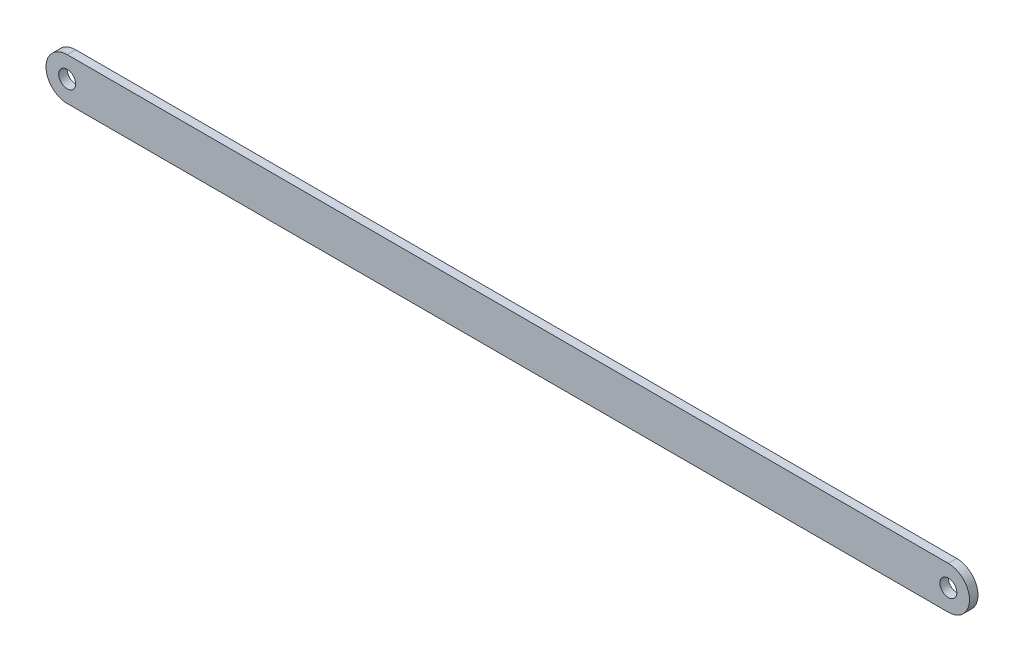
from build123d import *

# Parameters (mm, degrees)
BOSS_EXTRUDE1_DEPTH  = 5
M8_CLEARANCE_HOLE1_D = 10


with BuildPart() as part:
    # Sketch1 → Boss-Extrude1 (new body)
    with BuildSketch(Plane.XY):
        with BuildLine():
            Line((-260, 12.5), (260, 12.5))
            ThreePointArc((260, 12.5), (272.5, 0), (260, -12.5))
            Line((260, -12.5), (-260, -12.5))
            ThreePointArc((-260, -12.5), (-272.5, 0), (-260, 12.5))
        make_face()
    extrude(amount=BOSS_EXTRUDE1_DEPTH)

    # M8 Clearance Hole1 (through all)
    with Locations(Plane.XY.offset(5)):
        with Locations((260, 0), (-260, 0)):
            Hole(M8_CLEARANCE_HOLE1_D / 2)


solid = part.part
